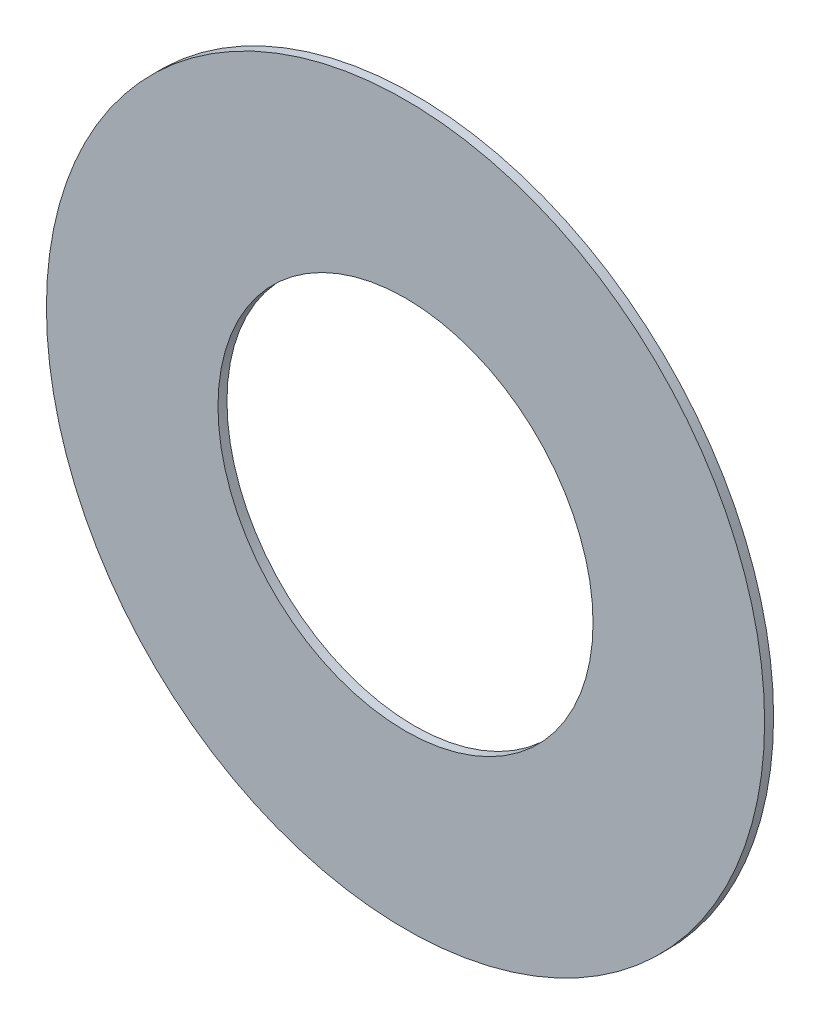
ISO-10303-21;
HEADER;
FILE_DESCRIPTION(('STEP AP214'),'2;1');
FILE_NAME('part.step','',(''),(''),'','','');
FILE_SCHEMA(('AUTOMOTIVE_DESIGN { 1 0 10303 214 1 1 1 1 }'));
ENDSEC;
DATA;
#1=APPLICATION_CONTEXT('core data for automotive mechanical design processes');
#2=APPLICATION_PROTOCOL_DEFINITION('international standard','automotive_design',2000,#1);
#3=PRODUCT_CONTEXT('',#1,'mechanical');
#4=PRODUCT('Part','Part','',(#3));
#5=PRODUCT_RELATED_PRODUCT_CATEGORY('part','',(#4));
#6=PRODUCT_DEFINITION_FORMATION('','',#4);
#7=PRODUCT_DEFINITION_CONTEXT('part definition',#1,'design');
#8=PRODUCT_DEFINITION('design','',#6,#7);
#9=PRODUCT_DEFINITION_SHAPE('','',#8);
#10=(LENGTH_UNIT() NAMED_UNIT(*) SI_UNIT(.MILLI.,.METRE.));
#11=(NAMED_UNIT(*) PLANE_ANGLE_UNIT() SI_UNIT($,.RADIAN.));
#12=(NAMED_UNIT(*) SI_UNIT($,.STERADIAN.) SOLID_ANGLE_UNIT());
#13=UNCERTAINTY_MEASURE_WITH_UNIT(LENGTH_MEASURE(1.E-05),#10,'distance_accuracy_value','');
#14=(GEOMETRIC_REPRESENTATION_CONTEXT(3) GLOBAL_UNCERTAINTY_ASSIGNED_CONTEXT((#13)) GLOBAL_UNIT_ASSIGNED_CONTEXT((#10,
#11,#12)) REPRESENTATION_CONTEXT('',''));
#15=CARTESIAN_POINT('',(0.,0.,0.));
#16=DIRECTION('',(0.,0.,1.));
#17=DIRECTION('',(1.,0.,0.));
#18=AXIS2_PLACEMENT_3D('',#15,#16,#17);
#19=CARTESIAN_POINT('',(0.,0.,11.43));
#20=DIRECTION('',(0.,0.,-1.));
#21=DIRECTION('',(-1.,0.,0.));
#22=AXIS2_PLACEMENT_3D('',#19,#20,#21);
#23=CYLINDRICAL_SURFACE('',#22,457.2);
#24=CARTESIAN_POINT('',(0.,0.,11.43));
#25=DIRECTION('',(0.,0.,1.));
#26=DIRECTION('',(1.,0.,0.));
#27=AXIS2_PLACEMENT_3D('',#24,#25,#26);
#28=CIRCLE('',#27,457.2);
#29=CARTESIAN_POINT('',(457.2,0.,11.43));
#30=VERTEX_POINT('',#29);
#31=EDGE_CURVE('E10',#30,#30,#28,.T.);
#32=ORIENTED_EDGE('',*,*,#31,.F.);
#33=EDGE_LOOP('',(#32));
#34=FACE_BOUND('',#33,.T.);
#35=CARTESIAN_POINT('',(0.,0.,0.));
#36=DIRECTION('',(0.,0.,1.));
#37=DIRECTION('',(1.,0.,0.));
#38=AXIS2_PLACEMENT_3D('',#35,#36,#37);
#39=CIRCLE('',#38,457.2);
#40=CARTESIAN_POINT('',(457.2,0.,0.));
#41=VERTEX_POINT('',#40);
#42=EDGE_CURVE('E38',#41,#41,#39,.T.);
#43=ORIENTED_EDGE('',*,*,#42,.T.);
#44=EDGE_LOOP('',(#43));
#45=FACE_BOUND('',#44,.T.);
#46=ADVANCED_FACE('F35',(#34,#45),#23,.T.);
#47=CARTESIAN_POINT('',(0.,0.,11.43));
#48=DIRECTION('',(0.,0.,1.));
#49=DIRECTION('',(1.,0.,0.));
#50=AXIS2_PLACEMENT_3D('',#47,#48,#49);
#51=PLANE('',#50);
#52=CARTESIAN_POINT('',(0.,0.,11.43));
#53=DIRECTION('',(0.,0.,1.));
#54=DIRECTION('',(1.,0.,0.));
#55=AXIS2_PLACEMENT_3D('',#52,#53,#54);
#56=CIRCLE('',#55,238.76);
#57=CARTESIAN_POINT('',(238.76,0.,11.43));
#58=VERTEX_POINT('',#57);
#59=EDGE_CURVE('E47',#58,#58,#56,.T.);
#60=ORIENTED_EDGE('',*,*,#59,.F.);
#61=EDGE_LOOP('',(#60));
#62=FACE_BOUND('',#61,.T.);
#63=ORIENTED_EDGE('',*,*,#31,.T.);
#64=EDGE_LOOP('',(#63));
#65=FACE_BOUND('',#64,.T.);
#66=ADVANCED_FACE('F62',(#62,#65),#51,.T.);
#67=CARTESIAN_POINT('',(0.,0.,0.));
#68=DIRECTION('',(0.,0.,1.));
#69=DIRECTION('',(1.,0.,0.));
#70=AXIS2_PLACEMENT_3D('',#67,#68,#69);
#71=PLANE('',#70);
#72=CARTESIAN_POINT('',(0.,0.,0.));
#73=DIRECTION('',(0.,0.,1.));
#74=DIRECTION('',(1.,0.,0.));
#75=AXIS2_PLACEMENT_3D('',#72,#73,#74);
#76=CIRCLE('',#75,238.76);
#77=CARTESIAN_POINT('',(238.76,0.,0.));
#78=VERTEX_POINT('',#77);
#79=EDGE_CURVE('E45',#78,#78,#76,.T.);
#80=ORIENTED_EDGE('',*,*,#79,.T.);
#81=EDGE_LOOP('',(#80));
#82=FACE_BOUND('',#81,.T.);
#83=ORIENTED_EDGE('',*,*,#42,.F.);
#84=EDGE_LOOP('',(#83));
#85=FACE_BOUND('',#84,.T.);
#86=ADVANCED_FACE('F53',(#82,#85),#71,.F.);
#87=CARTESIAN_POINT('',(0.,0.,0.));
#88=DIRECTION('',(0.,0.,1.));
#89=DIRECTION('',(1.,0.,0.));
#90=AXIS2_PLACEMENT_3D('',#87,#88,#89);
#91=CYLINDRICAL_SURFACE('',#90,238.76);
#92=ORIENTED_EDGE('',*,*,#79,.F.);
#93=EDGE_LOOP('',(#92));
#94=FACE_BOUND('',#93,.T.);
#95=ORIENTED_EDGE('',*,*,#59,.T.);
#96=EDGE_LOOP('',(#95));
#97=FACE_BOUND('',#96,.T.);
#98=ADVANCED_FACE('F56',(#94,#97),#91,.F.);
#99=CLOSED_SHELL('',(#46,#66,#86,#98));
#100=MANIFOLD_SOLID_BREP('B2',#99);
#101=ADVANCED_BREP_SHAPE_REPRESENTATION('',(#18,#100),#14);
#102=SHAPE_DEFINITION_REPRESENTATION(#9,#101);
ENDSEC;
END-ISO-10303-21;
